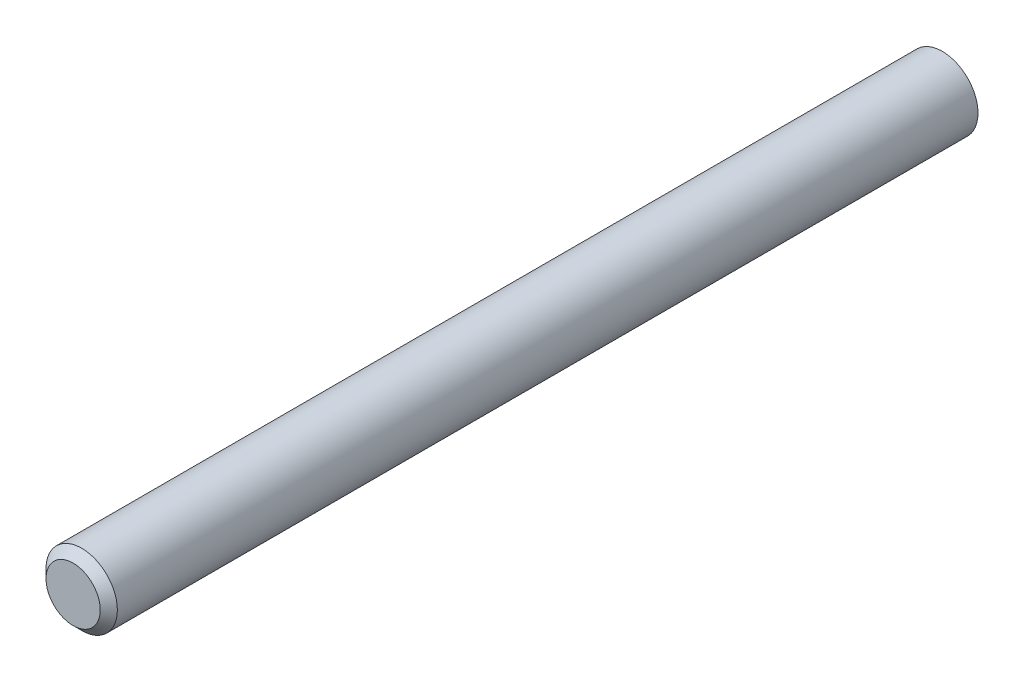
ISO-10303-21;
HEADER;
FILE_DESCRIPTION(('STEP AP214'),'2;1');
FILE_NAME('part.step','',(''),(''),'','','');
FILE_SCHEMA(('AUTOMOTIVE_DESIGN { 1 0 10303 214 1 1 1 1 }'));
ENDSEC;
DATA;
#1=APPLICATION_CONTEXT('core data for automotive mechanical design processes');
#2=APPLICATION_PROTOCOL_DEFINITION('international standard','automotive_design',2000,#1);
#3=PRODUCT_CONTEXT('',#1,'mechanical');
#4=PRODUCT('Part','Part','',(#3));
#5=PRODUCT_RELATED_PRODUCT_CATEGORY('part','',(#4));
#6=PRODUCT_DEFINITION_FORMATION('','',#4);
#7=PRODUCT_DEFINITION_CONTEXT('part definition',#1,'design');
#8=PRODUCT_DEFINITION('design','',#6,#7);
#9=PRODUCT_DEFINITION_SHAPE('','',#8);
#10=(LENGTH_UNIT() NAMED_UNIT(*) SI_UNIT(.MILLI.,.METRE.));
#11=(NAMED_UNIT(*) PLANE_ANGLE_UNIT() SI_UNIT($,.RADIAN.));
#12=(NAMED_UNIT(*) SI_UNIT($,.STERADIAN.) SOLID_ANGLE_UNIT());
#13=UNCERTAINTY_MEASURE_WITH_UNIT(LENGTH_MEASURE(1.E-05),#10,'distance_accuracy_value','');
#14=(GEOMETRIC_REPRESENTATION_CONTEXT(3) GLOBAL_UNCERTAINTY_ASSIGNED_CONTEXT((#13)) GLOBAL_UNIT_ASSIGNED_CONTEXT((#10,
#11,#12)) REPRESENTATION_CONTEXT('',''));
#15=CARTESIAN_POINT('',(0.,0.,0.));
#16=DIRECTION('',(0.,0.,1.));
#17=DIRECTION('',(1.,0.,0.));
#18=AXIS2_PLACEMENT_3D('',#15,#16,#17);
#19=CARTESIAN_POINT('',(0.,0.,77.343));
#20=DIRECTION('',(0.,0.,-1.));
#21=DIRECTION('',(-1.,0.,0.));
#22=AXIS2_PLACEMENT_3D('',#19,#20,#21);
#23=CYLINDRICAL_SURFACE('',#22,3.175);
#24=CARTESIAN_POINT('',(0.,0.,76.581));
#25=DIRECTION('',(0.,0.,1.));
#26=DIRECTION('',(1.,0.,0.));
#27=AXIS2_PLACEMENT_3D('',#24,#25,#26);
#28=CIRCLE('',#27,3.175);
#29=CARTESIAN_POINT('',(3.175,0.,76.581));
#30=VERTEX_POINT('',#29);
#31=EDGE_CURVE('E10',#30,#30,#28,.F.);
#32=ORIENTED_EDGE('',*,*,#31,.T.);
#33=EDGE_LOOP('',(#32));
#34=FACE_BOUND('',#33,.T.);
#35=CARTESIAN_POINT('',(0.,0.,0.));
#36=DIRECTION('',(0.,0.,1.));
#37=DIRECTION('',(1.,0.,0.));
#38=AXIS2_PLACEMENT_3D('',#35,#36,#37);
#39=CIRCLE('',#38,3.175);
#40=CARTESIAN_POINT('',(3.175,0.,0.));
#41=VERTEX_POINT('',#40);
#42=EDGE_CURVE('E44',#41,#41,#39,.T.);
#43=ORIENTED_EDGE('',*,*,#42,.T.);
#44=EDGE_LOOP('',(#43));
#45=FACE_BOUND('',#44,.T.);
#46=ADVANCED_FACE('F33',(#34,#45),#23,.T.);
#47=CARTESIAN_POINT('',(0.,0.,77.343));
#48=DIRECTION('',(0.,0.,1.));
#49=DIRECTION('',(1.,0.,0.));
#50=AXIS2_PLACEMENT_3D('',#47,#48,#49);
#51=PLANE('',#50);
#52=CARTESIAN_POINT('',(0.,0.,77.343));
#53=DIRECTION('',(0.,0.,1.));
#54=DIRECTION('',(1.,0.,0.));
#55=AXIS2_PLACEMENT_3D('',#52,#53,#54);
#56=CIRCLE('',#55,2.41300000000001);
#57=CARTESIAN_POINT('',(2.41300000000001,0.,77.343));
#58=VERTEX_POINT('',#57);
#59=EDGE_CURVE('E40',#58,#58,#56,.T.);
#60=ORIENTED_EDGE('',*,*,#59,.T.);
#61=EDGE_LOOP('',(#60));
#62=FACE_BOUND('',#61,.T.);
#63=ADVANCED_FACE('F54',(#62),#51,.T.);
#64=CARTESIAN_POINT('',(0.,0.,0.));
#65=DIRECTION('',(0.,0.,1.));
#66=DIRECTION('',(1.,0.,0.));
#67=AXIS2_PLACEMENT_3D('',#64,#65,#66);
#68=PLANE('',#67);
#69=ORIENTED_EDGE('',*,*,#42,.F.);
#70=EDGE_LOOP('',(#69));
#71=FACE_BOUND('',#70,.T.);
#72=ADVANCED_FACE('F52',(#71),#68,.F.);
#73=CARTESIAN_POINT('',(0.,0.,77.343));
#74=DIRECTION('',(0.,0.,-1.));
#75=DIRECTION('',(-1.,0.,0.));
#76=AXIS2_PLACEMENT_3D('',#73,#74,#75);
#77=CONICAL_SURFACE('',#76,2.41300000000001,0.78539816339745);
#78=ORIENTED_EDGE('',*,*,#31,.F.);
#79=EDGE_LOOP('',(#78));
#80=FACE_BOUND('',#79,.T.);
#81=ORIENTED_EDGE('',*,*,#59,.F.);
#82=EDGE_LOOP('',(#81));
#83=FACE_BOUND('',#82,.T.);
#84=ADVANCED_FACE('F35',(#80,#83),#77,.T.);
#85=CLOSED_SHELL('',(#46,#63,#72,#84));
#86=MANIFOLD_SOLID_BREP('B2',#85);
#87=ADVANCED_BREP_SHAPE_REPRESENTATION('',(#18,#86),#14);
#88=SHAPE_DEFINITION_REPRESENTATION(#9,#87);
ENDSEC;
END-ISO-10303-21;
